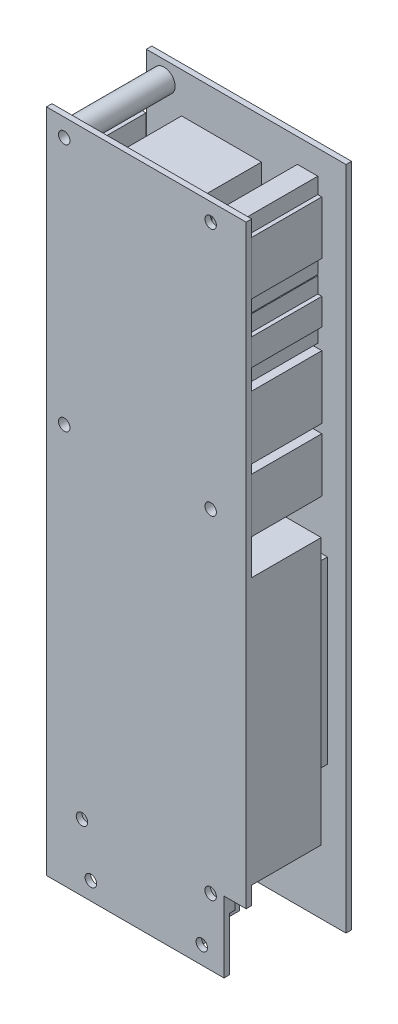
from build123d import *
from build123d.topology import SkipClean

# Parameters (mm, degrees)
SKETCH1_R             = 1.6383
PCB_CONTROLLER_DEPTH  = 1.5875
SKETCH2_W             = 50.8
SKETCH2_H             = 76.2
TT8_DEPTH             = 19.8882
SKETCH8_W             = 38.1
SKETCH8_H             = 6.0452
SKETCH8_W_2           = 6.35
SKETCH8_H_2           = 14.0462
SKETCH8_W_3           = 5.715
SKETCH8_H_3           = 18.034
SKETCH8_H_4           = 20.6756
SKETCH8_H_5           = 15.494
AMPMODUCONNS_DEPTH    = 20.32
SKETCH15_W            = 40.64
SKETCH15_H            = 51.3842
EXTRUDE10_DEPTH       = 6.858
SKETCH6_W             = 44.45
SKETCH6_H             = 25.4
REF_PCB_DEPTH         = 1.5875
SKETCH7_R             = 1.6383
REF_HOLES_DEPTH       = 202.884161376
EXTRUDE13_DEPTH       = 5.08
SKETCH21_R            = 6.35
EXTRUDE18_DEPTH       = 31.75
SKETCH22_W            = 22.86
SKETCH22_H            = 10.922
EXTRUDE19_DEPTH       = 16.764
EXTRUDE20_DEPTH       = 25.4
EXTRUDE20_DEPTH_BACK  = 7.239
SKETCH23_W            = 31.75
SKETCH23_H            = 1.27
SKETCH24_R            = 8.636
SKETCH24_W            = 2.54
SKETCH24_H            = 5.08
EXTRUDE21_DEPTH       = 10.16
SKETCH25_W            = 6.096
SKETCH25_H            = 6.096
EXTRUDE22_DEPTH       = 5.08
LPATTERN2_COUNT       = 4
LPATTERN2_PITCH       = 15.24
COVER_START           = 26.9875
SKETCH28_R            = 3.175
SKETCH28_R_2          = 1.6383
COVER_STANDOFFS_DEPTH = 26.9875
SKETCH29_W            = 57.15
SKETCH29_H            = 190.5
TOP_COVER_DEPTH       = 1.5875
SKETCH30_W            = 8.89
SKETCH30_H            = 20.0152
EXTRUDE23_DEPTH       = 9.525
SKETCH31_W            = 5.842
SKETCH31_H            = 17.018
EXTRUDE24_DEPTH       = 5.08


with BuildPart() as part:
    # Sketch1 → PCB-Controller (new body)
    with BuildSketch(Plane.XY):
        Polygon((-57.15, 190.5), (-57.15, 0), (-6.35, 0), (-6.35, 20.32), (0, 20.32), (0, 190.5), align=None)
        with Locations((-52.07, 185.42)):
            Circle(SKETCH1_R, mode=Mode.SUBTRACT)
        with Locations((-10.16, 185.42)):
            Circle(SKETCH1_R, mode=Mode.SUBTRACT)
        with Locations((-12.7, 5.08)):
            Circle(SKETCH1_R, mode=Mode.SUBTRACT)
        with Locations((-44.45, 5.08)):
            Circle(SKETCH1_R, mode=Mode.SUBTRACT)
        with Locations((-52.07, 114.3)):
            Circle(SKETCH1_R, mode=Mode.SUBTRACT)
        with Locations((-10.16, 114.3)):
            Circle(SKETCH1_R, mode=Mode.SUBTRACT)
    extrude(amount=PCB_CONTROLLER_DEPTH)

    # Sketch2 → TT8 (add)
    with BuildSketch(Plane.XY):
        with Locations((-25.4, 63.5)):
            Rectangle(SKETCH2_W, SKETCH2_H)
    extrude(amount=-TT8_DEPTH)

    # Sketch8 → AmpModuConns (add)
    with BuildSketch(Plane(origin=(0, 0, 0), x_dir=(-1, 0, 0), z_dir=(0, 0, -1))):
        Polygon((7.239, 153.416), (7.239, 148.844), (1.397, 148.844), (1.397, 153.416), (0.254, 153.416), (0.254, 161.036), (1.397, 161.036), (1.397, 165.608), (7.239, 165.608), (7.239, 161.036), (11.3284, 161.036), (11.3284, 153.416), align=None)
        with Locations((31.115, 107.1626)):
            Rectangle(SKETCH8_W, SKETCH8_H)
        Polygon((7.239, 170.434), (7.239, 165.862), (1.397, 165.862), (1.397, 170.434), (0.254, 170.434), (0.254, 185.674), (1.397, 185.674), (1.397, 190.246), (7.239, 190.246), (7.239, 185.674), (11.3284, 185.674), (11.3284, 170.434), align=None)
        with Locations((53.721, 174.3329)):
            Rectangle(SKETCH8_W_2, SKETCH8_H_2)
        with Locations((3.1115, 138.557)):
            Rectangle(SKETCH8_W_3, SKETCH8_H_3)
        with Locations((10.4775, 137.2362)):
            Rectangle(SKETCH8_W_3, SKETCH8_H_4)
        with Locations((3.1115, 119.253)):
            Rectangle(SKETCH8_W_3, SKETCH8_H_5)
    extrude(amount=AMPMODUCONNS_DEPTH)

    # Sketch15 → Extrude10 (add)
    with BuildSketch(Plane(origin=(0, 0, -19.8882), x_dir=(-1, 0, 0), z_dir=(0, 0, -1))):
        with Locations((25.4, 65.1383)):
            Rectangle(SKETCH15_W, SKETCH15_H)
    extrude(amount=EXTRUDE10_DEPTH)

    # Sketch6 → Ref PCB (add)
    with BuildSketch(Plane(origin=(0, 0, 0), x_dir=(-1, 0, 0), z_dir=(0, 0, -1))):
        with Locations((28.575, 27.94)):
            Rectangle(SKETCH6_W, SKETCH6_H)
    extrude(amount=REF_PCB_DEPTH)

    # Sketch7 → Ref holes (cut, through all)
    with BuildSketch(Plane(origin=(0, -1.27, 0), x_dir=(-1, 0, 0), z_dir=(0, 0, -1))):
        with Locations((10.16, 20.32)):
            Circle(SKETCH7_R)
        with Locations((46.99, 20.32)):
            Circle(SKETCH7_R)
    extrude(amount=-REF_HOLES_DEPTH, mode=Mode.SUBTRACT)

    # Sketch17 → Extrude13 (add)
    with BuildSketch(Plane(origin=(0, 0, 0), x_dir=(-1, 0, 0), z_dir=(0, 0, -1))):
        Polygon((45.156912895, 15.875), (48.823087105, 15.875), (50.656174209, 19.05), (48.823087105, 22.225), (45.156912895, 22.225), (43.323825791, 19.05), align=None)
        Polygon((6.493825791, 19.05), (8.326912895, 15.875), (11.993087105, 15.875), (13.826174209, 19.05), (11.993087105, 22.225), (8.326912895, 22.225), align=None)
    extrude(amount=EXTRUDE13_DEPTH)

    # Sketch21 → Extrude18 (add)
    with BuildSketch(Plane.ZY.offset(56.896)):
        with Locations((-6.3246, 157.226)):
            Circle(SKETCH21_R)
    extrude(amount=-EXTRUDE18_DEPTH)

    # Sketch22 → Extrude19 (add)
    with BuildSketch(Plane(origin=(0, 0, 0), x_dir=(-1, 0, 0), z_dir=(0, 0, -1))):
        with Locations((25.4, 183.769)):
            Rectangle(SKETCH22_W, SKETCH22_H)
    extrude(amount=EXTRUDE19_DEPTH)

    # Sketch23 → Extrude20 (add, two sides: drawn at the far end of the back side and taken through both)
    with BuildSketch(Plane(origin=(0, 110.1852, 0), x_dir=(1, 0, 0), z_dir=(0, 1, 0)).offset(-EXTRUDE20_DEPTH_BACK)):
        with Locations((-31.115, 19.177)):
            Rectangle(SKETCH23_W, SKETCH23_H)
    extrude(amount=EXTRUDE20_DEPTH + EXTRUDE20_DEPTH_BACK)

    # Sketch24 → Extrude21 (add)
    with BuildSketch(Plane(origin=(0, 0, 0), x_dir=(-1, 0, 0), z_dir=(0, 0, -1))):
        with Locations(Location((34.29, 9.525, 0), (0, 0, 138.56540144))):
            Circle(SKETCH24_R)
        with Locations((53.34, 3.81)):
            Rectangle(SKETCH24_W, SKETCH24_H)
        with Locations((53.34, 11.43)):
            Rectangle(SKETCH24_W, SKETCH24_H)
    extrude(amount=EXTRUDE21_DEPTH)

    # Sketch25 → Extrude22 (add)
    with BuildSketch(Plane(origin=(0, 0, 0), x_dir=(-1, 0, 0), z_dir=(0, 0, -1))):
        with Locations((53.848, 44.45)):
            Rectangle(SKETCH25_W, SKETCH25_H)
    extrude22 = extrude(amount=EXTRUDE22_DEPTH)

    # LPattern2: Extrude22 ×4
    with Locations(*[(0, i * LPATTERN2_PITCH, 0) for i in range(1, LPATTERN2_COUNT)]):
        add(extrude22)

    # Sketch28 → Cover Standoffs (add)
    # profile 1 of 3: a face of its own
    with SkipClean():  # the faces are left unmerged after this step: merging them gives an invalid solid
        with BuildSketch(Plane(origin=(0, 0, 0), x_dir=(-1, 0, 0), z_dir=(0, 0, -1)).offset(COVER_START)):
            with Locations((10.16, 114.3)):
                Circle(SKETCH28_R)
            with Locations((10.16, 114.3)):
                Circle(SKETCH28_R_2, mode=Mode.SUBTRACT)
        # profile 2 of 3: a face of its own
        with BuildSketch(Plane(origin=(0, 0, 0), x_dir=(-1, 0, 0), z_dir=(0, 0, -1)).offset(COVER_START)):
            with Locations((52.07, 114.3)):
                Circle(SKETCH28_R)
            with Locations((52.07, 114.3)):
                Circle(SKETCH28_R_2, mode=Mode.SUBTRACT)
        # profile 3 of 3: a face of its own
        with BuildSketch(Plane(origin=(0, 0, 0), x_dir=(-1, 0, 0), z_dir=(0, 0, -1)).offset(COVER_START)):
            with Locations((52.07, 185.42)):
                Circle(SKETCH28_R)
            with Locations((52.07, 185.42)):
                Circle(SKETCH28_R_2, mode=Mode.SUBTRACT)
        extrude(amount=-COVER_STANDOFFS_DEPTH)

    # Sketch29 → Top Cover (add)
    with SkipClean():  # the faces are left unmerged after this step: merging them gives an invalid solid
        with BuildSketch(Plane(origin=(0, 0, -26.9875), x_dir=(-1, 0, 0), z_dir=(0, 0, -1))):
            with Locations((28.575, 95.25)):
                Rectangle(SKETCH29_W, SKETCH29_H)
        extrude(amount=TOP_COVER_DEPTH)

    # Sketch30 → Extrude23 (add)
    with SkipClean():  # the faces are left unmerged after this step: merging them gives an invalid solid
        with BuildSketch(Plane(origin=(0, 0, 0), x_dir=(-1, 0, 0), z_dir=(0, 0, -1))):
            with Locations((20.96008, 11.2522)):
                Rectangle(SKETCH30_W, SKETCH30_H)
        extrude(amount=EXTRUDE23_DEPTH)

    # Sketch31 → Extrude24 (add)
    with SkipClean():  # the faces are left unmerged after this step: merging them gives an invalid solid
        with BuildSketch(Plane(origin=(0, 0, -9.525), x_dir=(-1, 0, 0), z_dir=(0, 0, -1))):
            with Locations((20.96008, 11.2522)):
                Rectangle(SKETCH31_W, SKETCH31_H)
        extrude(amount=EXTRUDE24_DEPTH)


solid = part.part
